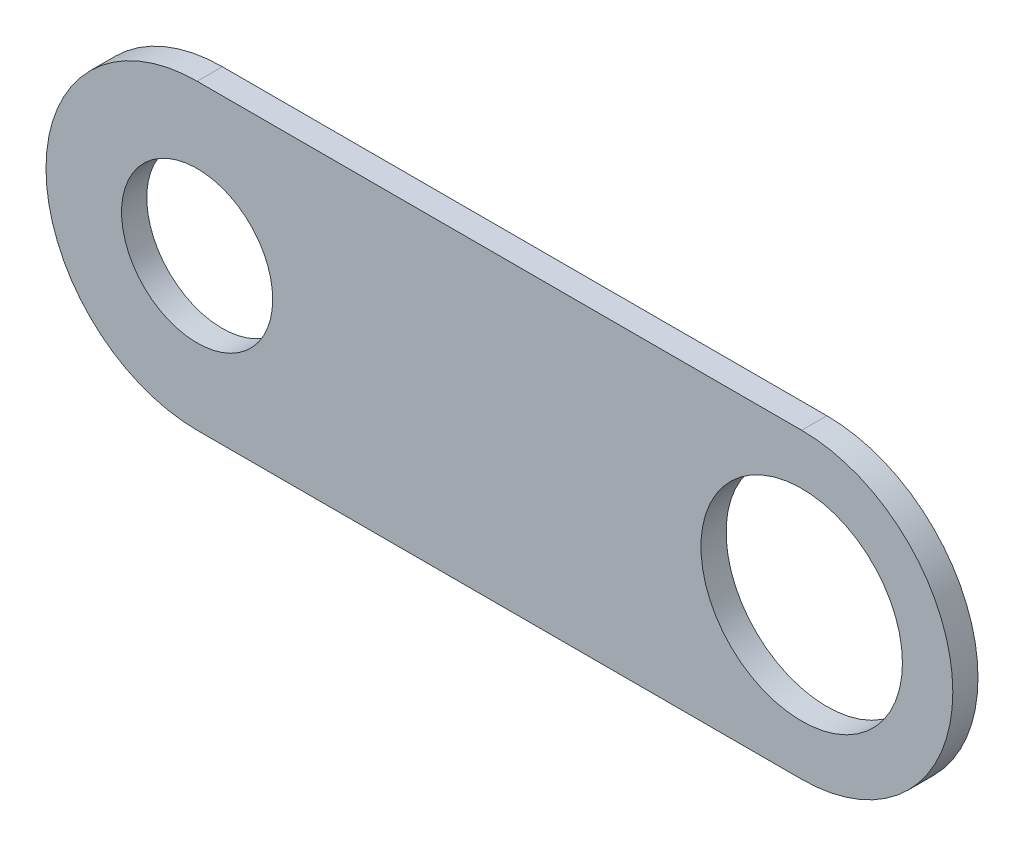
from build123d import *

# Parameters (mm, degrees)
SKETCH1_R           = 9.525
SKETCH1_R_2         = 12.7
BOSS_EXTRUDE1_DEPTH = 1.5875


with BuildPart() as part:
    # Sketch1 → Boss-Extrude1 (new, symmetric)
    with BuildSketch(Plane.XY):
        with BuildLine():
            Line((0, 0), (76.2, 0))
            ThreePointArc((76.2, 0), (95.25, -19.05), (76.2, -38.1))
            Line((76.2, -38.1), (0, -38.1))
            ThreePointArc((0, -38.1), (-19.05, -19.05), (0, 0))
        make_face()
        with Locations((0, -19.05)):
            Circle(SKETCH1_R, mode=Mode.SUBTRACT)
        with Locations((76.2, -19.05)):
            Circle(SKETCH1_R_2, mode=Mode.SUBTRACT)
    extrude(amount=BOSS_EXTRUDE1_DEPTH, both=True)


solid = part.part
